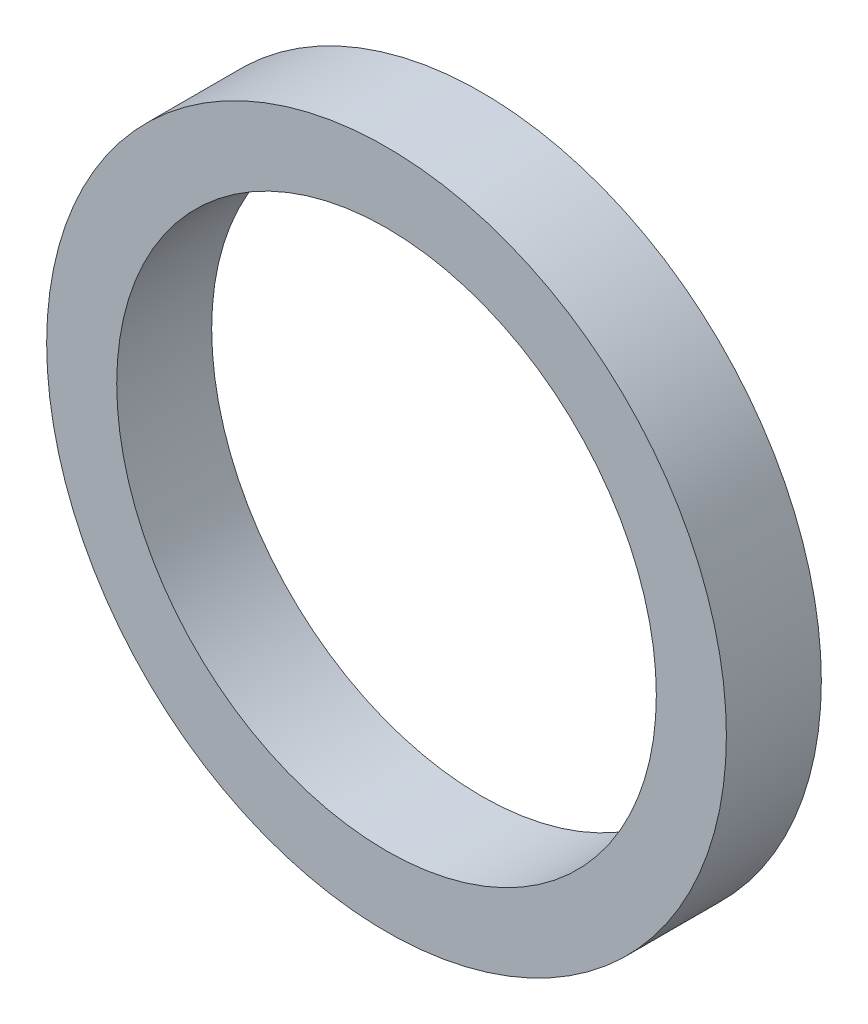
ISO-10303-21;
HEADER;
FILE_DESCRIPTION(('STEP AP214'),'2;1');
FILE_NAME('part.step','',(''),(''),'','','');
FILE_SCHEMA(('AUTOMOTIVE_DESIGN { 1 0 10303 214 1 1 1 1 }'));
ENDSEC;
DATA;
#1=APPLICATION_CONTEXT('core data for automotive mechanical design processes');
#2=APPLICATION_PROTOCOL_DEFINITION('international standard','automotive_design',2000,#1);
#3=PRODUCT_CONTEXT('',#1,'mechanical');
#4=PRODUCT('Part','Part','',(#3));
#5=PRODUCT_RELATED_PRODUCT_CATEGORY('part','',(#4));
#6=PRODUCT_DEFINITION_FORMATION('','',#4);
#7=PRODUCT_DEFINITION_CONTEXT('part definition',#1,'design');
#8=PRODUCT_DEFINITION('design','',#6,#7);
#9=PRODUCT_DEFINITION_SHAPE('','',#8);
#10=(LENGTH_UNIT() NAMED_UNIT(*) SI_UNIT(.MILLI.,.METRE.));
#11=(NAMED_UNIT(*) PLANE_ANGLE_UNIT() SI_UNIT($,.RADIAN.));
#12=(NAMED_UNIT(*) SI_UNIT($,.STERADIAN.) SOLID_ANGLE_UNIT());
#13=UNCERTAINTY_MEASURE_WITH_UNIT(LENGTH_MEASURE(1.E-05),#10,'distance_accuracy_value','');
#14=(GEOMETRIC_REPRESENTATION_CONTEXT(3) GLOBAL_UNCERTAINTY_ASSIGNED_CONTEXT((#13)) GLOBAL_UNIT_ASSIGNED_CONTEXT((#10,
#11,#12)) REPRESENTATION_CONTEXT('',''));
#15=CARTESIAN_POINT('',(0.,0.,0.));
#16=DIRECTION('',(0.,0.,1.));
#17=DIRECTION('',(1.,0.,0.));
#18=AXIS2_PLACEMENT_3D('',#15,#16,#17);
#19=CARTESIAN_POINT('',(0.,11.65,0.));
#20=DIRECTION('',(0.,0.,-1.));
#21=DIRECTION('',(-1.,0.,0.));
#22=AXIS2_PLACEMENT_3D('',#19,#20,#21);
#23=PLANE('',#22);
#24=CARTESIAN_POINT('',(0.,0.,0.));
#25=DIRECTION('',(0.,0.,1.));
#26=DIRECTION('',(1.,0.,0.));
#27=AXIS2_PLACEMENT_3D('',#24,#25,#26);
#28=CIRCLE('',#27,11.65);
#29=CARTESIAN_POINT('',(11.65,0.,0.));
#30=VERTEX_POINT('',#29);
#31=EDGE_CURVE('E43',#30,#30,#28,.T.);
#32=ORIENTED_EDGE('',*,*,#31,.F.);
#33=EDGE_LOOP('',(#32));
#34=FACE_BOUND('',#33,.T.);
#35=CARTESIAN_POINT('',(0.,0.,0.));
#36=DIRECTION('',(0.,0.,1.));
#37=DIRECTION('',(1.,0.,0.));
#38=AXIS2_PLACEMENT_3D('',#35,#36,#37);
#39=CIRCLE('',#38,14.675);
#40=CARTESIAN_POINT('',(14.675,0.,0.));
#41=VERTEX_POINT('',#40);
#42=EDGE_CURVE('E10',#41,#41,#39,.T.);
#43=ORIENTED_EDGE('',*,*,#42,.T.);
#44=EDGE_LOOP('',(#43));
#45=FACE_BOUND('',#44,.T.);
#46=ADVANCED_FACE('F29',(#34,#45),#23,.F.);
#47=CARTESIAN_POINT('',(0.,0.,0.));
#48=DIRECTION('',(0.,0.,1.));
#49=DIRECTION('',(1.,0.,0.));
#50=AXIS2_PLACEMENT_3D('',#47,#48,#49);
#51=CYLINDRICAL_SURFACE('',#50,14.675);
#52=ORIENTED_EDGE('',*,*,#42,.F.);
#53=EDGE_LOOP('',(#52));
#54=FACE_BOUND('',#53,.T.);
#55=CARTESIAN_POINT('',(0.,0.,-4.1));
#56=DIRECTION('',(0.,0.,1.));
#57=DIRECTION('',(1.,0.,0.));
#58=AXIS2_PLACEMENT_3D('',#55,#56,#57);
#59=CIRCLE('',#58,14.675);
#60=CARTESIAN_POINT('',(14.675,0.,-4.1));
#61=VERTEX_POINT('',#60);
#62=EDGE_CURVE('E35',#61,#61,#59,.T.);
#63=ORIENTED_EDGE('',*,*,#62,.T.);
#64=EDGE_LOOP('',(#63));
#65=FACE_BOUND('',#64,.T.);
#66=ADVANCED_FACE('F52',(#54,#65),#51,.T.);
#67=CARTESIAN_POINT('',(0.,11.65,-4.1));
#68=DIRECTION('',(0.,0.,1.));
#69=DIRECTION('',(1.,0.,0.));
#70=AXIS2_PLACEMENT_3D('',#67,#68,#69);
#71=PLANE('',#70);
#72=ORIENTED_EDGE('',*,*,#62,.F.);
#73=EDGE_LOOP('',(#72));
#74=FACE_BOUND('',#73,.T.);
#75=CARTESIAN_POINT('',(0.,0.,-4.1));
#76=DIRECTION('',(0.,0.,1.));
#77=DIRECTION('',(1.,0.,0.));
#78=AXIS2_PLACEMENT_3D('',#75,#76,#77);
#79=CIRCLE('',#78,11.65);
#80=CARTESIAN_POINT('',(11.65,0.,-4.1));
#81=VERTEX_POINT('',#80);
#82=EDGE_CURVE('E39',#81,#81,#79,.T.);
#83=ORIENTED_EDGE('',*,*,#82,.T.);
#84=EDGE_LOOP('',(#83));
#85=FACE_BOUND('',#84,.T.);
#86=ADVANCED_FACE('F56',(#74,#85),#71,.F.);
#87=CARTESIAN_POINT('',(0.,0.,0.));
#88=DIRECTION('',(0.,0.,1.));
#89=DIRECTION('',(1.,0.,0.));
#90=AXIS2_PLACEMENT_3D('',#87,#88,#89);
#91=CYLINDRICAL_SURFACE('',#90,11.65);
#92=ORIENTED_EDGE('',*,*,#82,.F.);
#93=EDGE_LOOP('',(#92));
#94=FACE_BOUND('',#93,.T.);
#95=ORIENTED_EDGE('',*,*,#31,.T.);
#96=EDGE_LOOP('',(#95));
#97=FACE_BOUND('',#96,.T.);
#98=ADVANCED_FACE('F49',(#94,#97),#91,.F.);
#99=CLOSED_SHELL('',(#46,#66,#86,#98));
#100=MANIFOLD_SOLID_BREP('B2',#99);
#101=ADVANCED_BREP_SHAPE_REPRESENTATION('',(#18,#100),#14);
#102=SHAPE_DEFINITION_REPRESENTATION(#9,#101);
ENDSEC;
END-ISO-10303-21;
